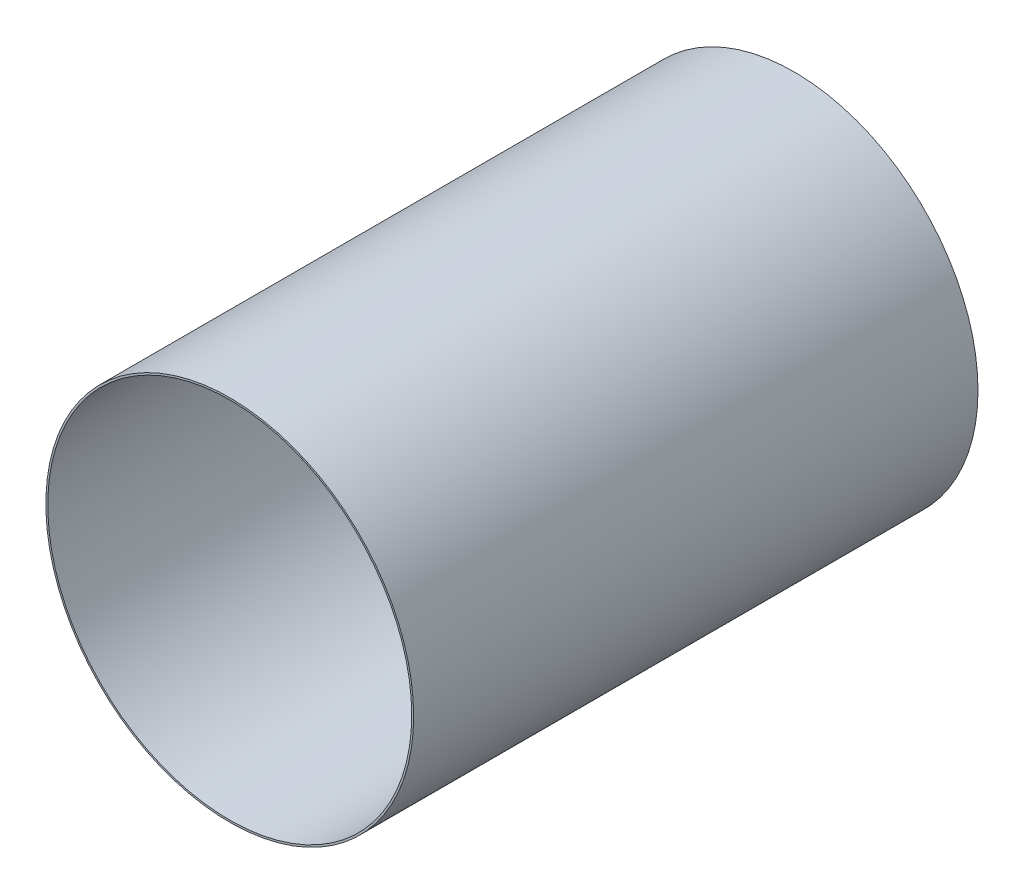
ISO-10303-21;
HEADER;
FILE_DESCRIPTION(('STEP AP214'),'2;1');
FILE_NAME('part.step','',(''),(''),'','','');
FILE_SCHEMA(('AUTOMOTIVE_DESIGN { 1 0 10303 214 1 1 1 1 }'));
ENDSEC;
DATA;
#1=APPLICATION_CONTEXT('core data for automotive mechanical design processes');
#2=APPLICATION_PROTOCOL_DEFINITION('international standard','automotive_design',2000,#1);
#3=PRODUCT_CONTEXT('',#1,'mechanical');
#4=PRODUCT('Part','Part','',(#3));
#5=PRODUCT_RELATED_PRODUCT_CATEGORY('part','',(#4));
#6=PRODUCT_DEFINITION_FORMATION('','',#4);
#7=PRODUCT_DEFINITION_CONTEXT('part definition',#1,'design');
#8=PRODUCT_DEFINITION('design','',#6,#7);
#9=PRODUCT_DEFINITION_SHAPE('','',#8);
#10=(LENGTH_UNIT() NAMED_UNIT(*) SI_UNIT(.MILLI.,.METRE.));
#11=(NAMED_UNIT(*) PLANE_ANGLE_UNIT() SI_UNIT($,.RADIAN.));
#12=(NAMED_UNIT(*) SI_UNIT($,.STERADIAN.) SOLID_ANGLE_UNIT());
#13=UNCERTAINTY_MEASURE_WITH_UNIT(LENGTH_MEASURE(1.E-05),#10,'distance_accuracy_value','');
#14=(GEOMETRIC_REPRESENTATION_CONTEXT(3) GLOBAL_UNCERTAINTY_ASSIGNED_CONTEXT((#13)) GLOBAL_UNIT_ASSIGNED_CONTEXT((#10,
#11,#12)) REPRESENTATION_CONTEXT('',''));
#15=CARTESIAN_POINT('',(0.,0.,0.));
#16=DIRECTION('',(0.,0.,1.));
#17=DIRECTION('',(1.,0.,0.));
#18=AXIS2_PLACEMENT_3D('',#15,#16,#17);
#19=CARTESIAN_POINT('',(0.,0.,890.));
#20=DIRECTION('',(0.,0.,-1.));
#21=DIRECTION('',(-1.,0.,0.));
#22=AXIS2_PLACEMENT_3D('',#19,#20,#21);
#23=CYLINDRICAL_SURFACE('',#22,290.);
#24=CARTESIAN_POINT('',(0.,0.,890.));
#25=DIRECTION('',(0.,0.,1.));
#26=DIRECTION('',(1.,0.,0.));
#27=AXIS2_PLACEMENT_3D('',#24,#25,#26);
#28=CIRCLE('',#27,290.);
#29=CARTESIAN_POINT('',(290.,0.,890.));
#30=VERTEX_POINT('',#29);
#31=EDGE_CURVE('E10',#30,#30,#28,.T.);
#32=ORIENTED_EDGE('',*,*,#31,.F.);
#33=EDGE_LOOP('',(#32));
#34=FACE_BOUND('',#33,.T.);
#35=CARTESIAN_POINT('',(0.,0.,0.));
#36=DIRECTION('',(0.,0.,1.));
#37=DIRECTION('',(1.,0.,0.));
#38=AXIS2_PLACEMENT_3D('',#35,#36,#37);
#39=CIRCLE('',#38,290.);
#40=CARTESIAN_POINT('',(290.,0.,0.));
#41=VERTEX_POINT('',#40);
#42=EDGE_CURVE('E34',#41,#41,#39,.T.);
#43=ORIENTED_EDGE('',*,*,#42,.T.);
#44=EDGE_LOOP('',(#43));
#45=FACE_BOUND('',#44,.T.);
#46=ADVANCED_FACE('F31',(#34,#45),#23,.T.);
#47=CARTESIAN_POINT('',(0.,0.,890.));
#48=DIRECTION('',(0.,0.,1.));
#49=DIRECTION('',(1.,0.,0.));
#50=AXIS2_PLACEMENT_3D('',#47,#48,#49);
#51=PLANE('',#50);
#52=CARTESIAN_POINT('',(0.,0.,890.));
#53=DIRECTION('',(0.,0.,1.));
#54=DIRECTION('',(1.,0.,0.));
#55=AXIS2_PLACEMENT_3D('',#52,#53,#54);
#56=CIRCLE('',#55,287.);
#57=CARTESIAN_POINT('',(287.,0.,890.));
#58=VERTEX_POINT('',#57);
#59=EDGE_CURVE('E41',#58,#58,#56,.T.);
#60=ORIENTED_EDGE('',*,*,#59,.F.);
#61=EDGE_LOOP('',(#60));
#62=FACE_BOUND('',#61,.T.);
#63=ORIENTED_EDGE('',*,*,#31,.T.);
#64=EDGE_LOOP('',(#63));
#65=FACE_BOUND('',#64,.T.);
#66=ADVANCED_FACE('F61',(#62,#65),#51,.T.);
#67=CARTESIAN_POINT('',(0.,0.,0.));
#68=DIRECTION('',(0.,0.,1.));
#69=DIRECTION('',(1.,0.,0.));
#70=AXIS2_PLACEMENT_3D('',#67,#68,#69);
#71=PLANE('',#70);
#72=ORIENTED_EDGE('',*,*,#42,.F.);
#73=EDGE_LOOP('',(#72));
#74=FACE_BOUND('',#73,.T.);
#75=ADVANCED_FACE('F53',(#74),#71,.F.);
#76=CARTESIAN_POINT('',(0.,0.,890.));
#77=DIRECTION('',(0.,0.,-1.));
#78=DIRECTION('',(-1.,0.,0.));
#79=AXIS2_PLACEMENT_3D('',#76,#77,#78);
#80=CYLINDRICAL_SURFACE('',#79,287.);
#81=ORIENTED_EDGE('',*,*,#59,.T.);
#82=EDGE_LOOP('',(#81));
#83=FACE_BOUND('',#82,.T.);
#84=CARTESIAN_POINT('',(0.,0.,3.));
#85=DIRECTION('',(0.,0.,1.));
#86=DIRECTION('',(1.,0.,0.));
#87=AXIS2_PLACEMENT_3D('',#84,#85,#86);
#88=CIRCLE('',#87,287.);
#89=CARTESIAN_POINT('',(287.,0.,3.));
#90=VERTEX_POINT('',#89);
#91=EDGE_CURVE('E45',#90,#90,#88,.T.);
#92=ORIENTED_EDGE('',*,*,#91,.F.);
#93=EDGE_LOOP('',(#92));
#94=FACE_BOUND('',#93,.T.);
#95=ADVANCED_FACE('F51',(#83,#94),#80,.F.);
#96=CARTESIAN_POINT('',(0.,0.,3.));
#97=DIRECTION('',(0.,0.,1.));
#98=DIRECTION('',(1.,0.,0.));
#99=AXIS2_PLACEMENT_3D('',#96,#97,#98);
#100=PLANE('',#99);
#101=ORIENTED_EDGE('',*,*,#91,.T.);
#102=EDGE_LOOP('',(#101));
#103=FACE_BOUND('',#102,.T.);
#104=ADVANCED_FACE('F49',(#103),#100,.T.);
#105=CLOSED_SHELL('',(#46,#66,#75,#95,#104));
#106=MANIFOLD_SOLID_BREP('B2',#105);
#107=ADVANCED_BREP_SHAPE_REPRESENTATION('',(#18,#106),#14);
#108=SHAPE_DEFINITION_REPRESENTATION(#9,#107);
ENDSEC;
END-ISO-10303-21;
